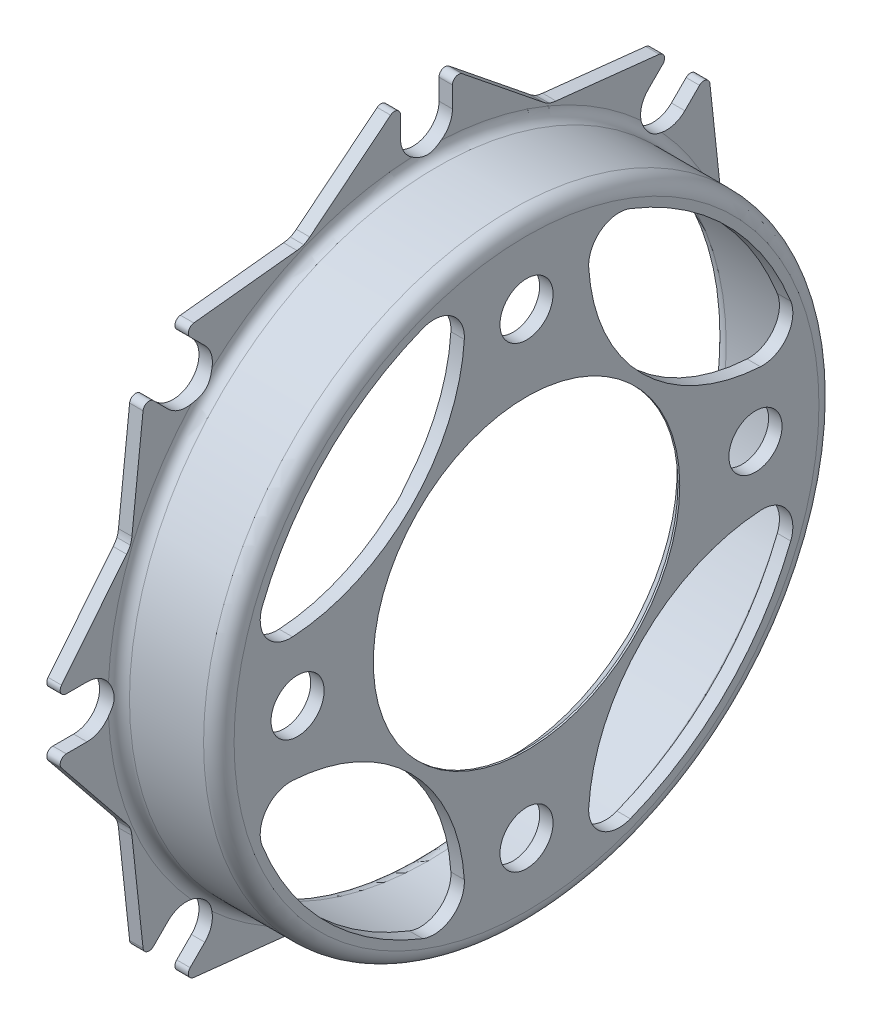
from build123d import *

# Parameters (mm, degrees)
CUT_EXTRUDE1_REACH = 129.92
SKETCH2_R          = 5.5245
CIRPATTERN1_COUNT  = 4
CUT_EXTRUDE2_REACH = 129.92
CIRPATTERN2_COUNT  = 4
CUT_EXTRUDE4_DEPTH = 128.920206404
CIRPATTERN4_COUNT  = 8


with BuildPart() as part:
    # Sketch1 → Revolve1 (revolve)
    with BuildSketch(Plane.XY, mode=Mode.PRIVATE) as revolve1_sk:
        with BuildLine():
            Line((20.81022, 34.127158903), (20.81022, 59.7535))
            ThreePointArc((20.81022, 59.7535), (20.159264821, 61.325044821), (18.58772, 61.976))
            Line((18.58772, 61.976), (3.175, 61.976))
            ThreePointArc((3.175, 61.976), (0.92993597, 62.90593597), (0, 65.151))
            Line((0, 65.151), (0, 88.9))
            Line((0, 88.9), (2.794, 88.9))
            Line((2.794, 88.9), (2.794, 66.2305))
            ThreePointArc((2.794, 66.2305), (3.444955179, 64.658955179), (5.0165, 64.008))
            Line((5.0165, 64.008), (20.42922, 64.008))
            ThreePointArc((20.42922, 64.008), (22.67428403, 63.07806403), (23.60422, 60.833))
            Line((23.60422, 60.833), (23.60422, 31.877))
            Line((23.60422, 31.877), (23.22322, 31.877))
            Line((23.22322, 31.877), (20.81022, 34.127158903))
        make_face()
    revolve(revolve1_sk.sketch.rotate(Axis((25.8699, 0, 0), (-1, 0, 0)), 90), axis=Axis((25.8699, 0, 0), (-1, 0, 0)))

    # Sketch2 → Cut-Extrude1 (cut, up to next)
    with BuildSketch(Plane(origin=(23.60422, 0, 0), x_dir=(0, 0, -1), z_dir=(1, 0, 0)), mode=Mode.PRIVATE) as cut_extrude1_sk1:
        with Locations((0, 47.625)):
            Circle(SKETCH2_R)
    cut_extrude1_tool1 = extrude(cut_extrude1_sk1.sketch, amount=-CUT_EXTRUDE1_REACH, mode=Mode.PRIVATE) & part.part
    cut_extrude1 = cut_extrude1_tool1.solids().sort_by_distance((23.60422, 47.625, 0))[0]
    add(cut_extrude1, mode=Mode.SUBTRACT)

    # CirPattern1: Cut-Extrude1 ×4 about axis
    cirpattern1_axis = Axis((0, 0, 0), (1, 0, 0))
    for i in range(1, CIRPATTERN1_COUNT):
        add(cut_extrude1.rotate(cirpattern1_axis, i * 360 / CIRPATTERN1_COUNT), mode=Mode.SUBTRACT)

    # Sketch3 → Cut-Extrude2 (cut, up to next)
    with BuildSketch(Plane(origin=(23.60422, 0, 0), x_dir=(0, 0, -1), z_dir=(1, 0, 0)), mode=Mode.PRIVATE) as cut_extrude2_sk1:
        with BuildLine():
            ThreePointArc((54.961942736, 21.60272843), (41.758190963, 41.758190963), (21.60272843, 54.961942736))
            ThreePointArc((21.60272843, 54.961942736), (15.547007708, 54.189016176), (12.941472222, 48.66811464))
            ThreePointArc((12.941472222, 48.66811464), (24.030996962, 24.030996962), (48.66811464, 12.941472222))
            ThreePointArc((48.66811464, 12.941472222), (54.189016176, 15.547007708), (54.961942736, 21.60272843))
        make_face()
    cut_extrude2_tool1 = extrude(cut_extrude2_sk1.sketch, amount=-CUT_EXTRUDE2_REACH, mode=Mode.PRIVATE) & part.part
    cut_extrude2 = cut_extrude2_tool1.solids().sort_by_distance((23.60422, 33.241486, -33.241486))[0]
    add(cut_extrude2, mode=Mode.SUBTRACT)

    # CirPattern2: Cut-Extrude2 ×4 about axis
    cirpattern2_axis = Axis((0, 0, 0), (1, 0, 0))
    for i in range(1, CIRPATTERN2_COUNT):
        add(cut_extrude2.rotate(cirpattern2_axis, i * 360 / CIRPATTERN2_COUNT), mode=Mode.SUBTRACT)

    # Sketch5 → Cut-Extrude4 (cut, through all)
    with BuildSketch(Plane.ZY):
        with BuildLine():
            Line((-7.463999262, 75.919185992), (-24.280161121, 62.378698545))
            ThreePointArc((-24.280161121, 62.378698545), (-24.875319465, 61.953553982), (-25.515417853, 61.59966783))
            Line((-25.515417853, 61.59966783), (-34.020557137, 82.13289044))
            ThreePointArc((-34.020557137, 82.13289044), (0, 88.9), (34.020557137, 82.13289044))
            Line((34.020557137, 82.13289044), (25.515417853, 61.59966783))
            ThreePointArc((25.515417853, 61.59966783), (24.875319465, 61.953553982), (24.280161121, 62.378698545))
            Line((24.280161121, 62.378698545), (7.463999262, 75.919185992))
            ThreePointArc((7.463999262, 75.919185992), (6.119163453, 76.075524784), (5.3975, 74.93))
            Line((5.3975, 74.93), (5.3975, 70.612))
            ThreePointArc((5.3975, 70.612), (0, 65.2145), (-5.3975, 70.612))
            Line((-5.3975, 70.612), (-5.3975, 74.93))
            ThreePointArc((-5.3975, 74.93), (-6.119163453, 76.075524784), (-7.463999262, 75.919185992))
        make_face()
    cut_extrude4 = extrude(amount=-CUT_EXTRUDE4_DEPTH, mode=Mode.SUBTRACT)

    # CirPattern4: Cut-Extrude4 ×8 about axis
    cirpattern4_axis = Axis((0, 0, 0), (1, 0, 0))
    for i in range(1, CIRPATTERN4_COUNT):
        add(cut_extrude4.rotate(cirpattern4_axis, i * 360 / CIRPATTERN4_COUNT), mode=Mode.SUBTRACT)


solid = part.part
